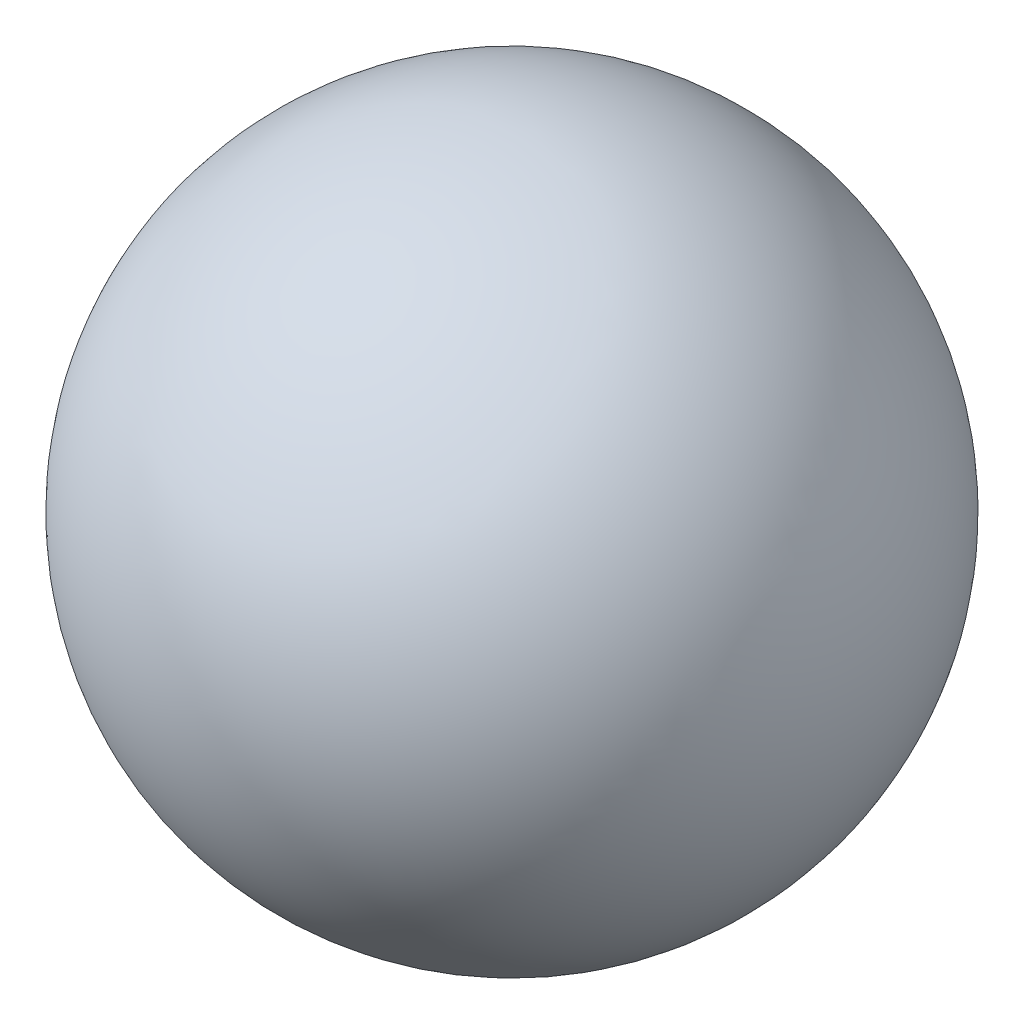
from build123d import *


with BuildPart() as part:
    # Sketch1 → Revolve1 (revolve)
    with BuildSketch(Plane.XY):
        with BuildLine():
            Line((-3.9, 0), (3.9, 0))
            ThreePointArc((3.9, 0), (0, 3.9), (-3.9, 0))
        make_face()
    revolve(axis=Axis((-13.496557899, 0, 0), (1, 0, 0)))


solid = part.part
